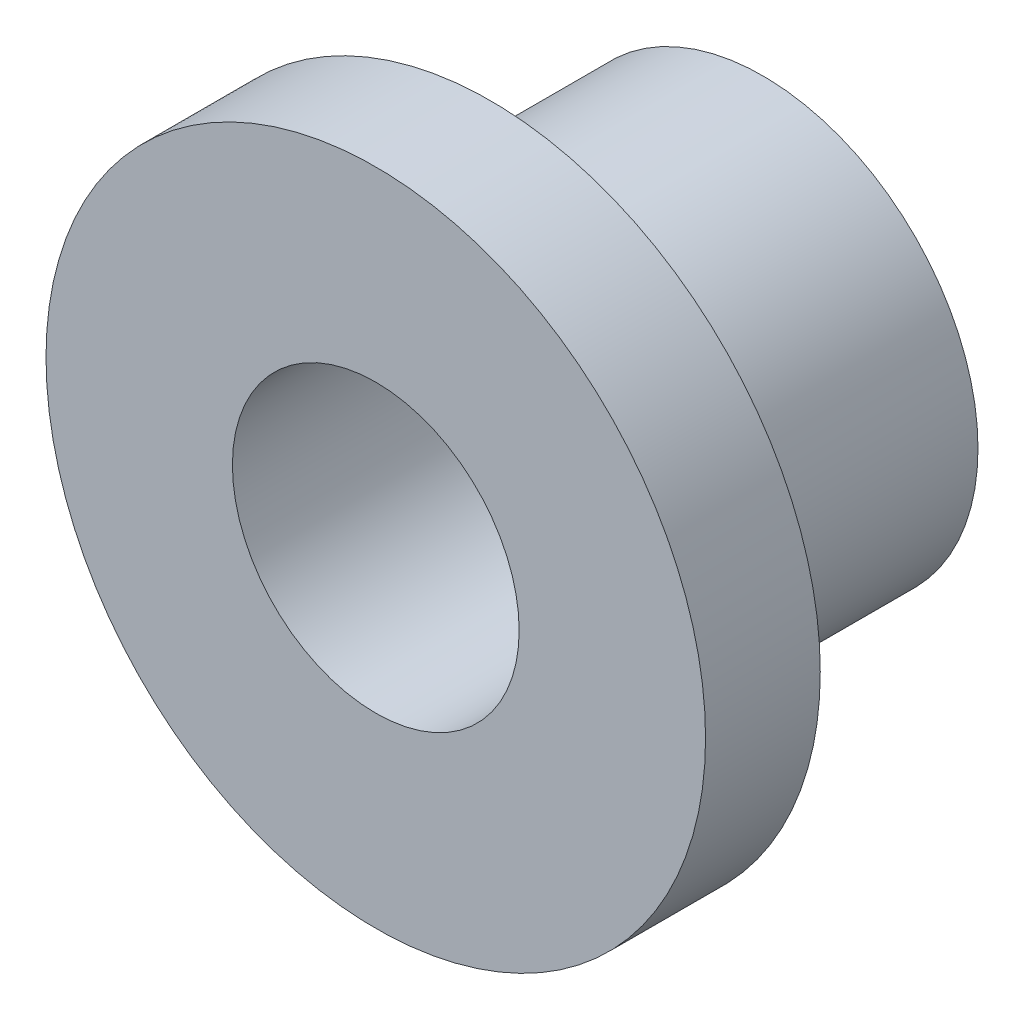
ISO-10303-21;
HEADER;
FILE_DESCRIPTION(('STEP AP214'),'2;1');
FILE_NAME('part.step','',(''),(''),'','','');
FILE_SCHEMA(('AUTOMOTIVE_DESIGN { 1 0 10303 214 1 1 1 1 }'));
ENDSEC;
DATA;
#1=APPLICATION_CONTEXT('core data for automotive mechanical design processes');
#2=APPLICATION_PROTOCOL_DEFINITION('international standard','automotive_design',2000,#1);
#3=PRODUCT_CONTEXT('',#1,'mechanical');
#4=PRODUCT('Part','Part','',(#3));
#5=PRODUCT_RELATED_PRODUCT_CATEGORY('part','',(#4));
#6=PRODUCT_DEFINITION_FORMATION('','',#4);
#7=PRODUCT_DEFINITION_CONTEXT('part definition',#1,'design');
#8=PRODUCT_DEFINITION('design','',#6,#7);
#9=PRODUCT_DEFINITION_SHAPE('','',#8);
#10=(LENGTH_UNIT() NAMED_UNIT(*) SI_UNIT(.MILLI.,.METRE.));
#11=(NAMED_UNIT(*) PLANE_ANGLE_UNIT() SI_UNIT($,.RADIAN.));
#12=(NAMED_UNIT(*) SI_UNIT($,.STERADIAN.) SOLID_ANGLE_UNIT());
#13=UNCERTAINTY_MEASURE_WITH_UNIT(LENGTH_MEASURE(1.E-05),#10,'distance_accuracy_value','');
#14=(GEOMETRIC_REPRESENTATION_CONTEXT(3) GLOBAL_UNCERTAINTY_ASSIGNED_CONTEXT((#13)) GLOBAL_UNIT_ASSIGNED_CONTEXT((#10,
#11,#12)) REPRESENTATION_CONTEXT('',''));
#15=CARTESIAN_POINT('',(0.,0.,0.));
#16=DIRECTION('',(0.,0.,1.));
#17=DIRECTION('',(1.,0.,0.));
#18=AXIS2_PLACEMENT_3D('',#15,#16,#17);
#19=CARTESIAN_POINT('',(0.,0.,27.));
#20=DIRECTION('',(0.,0.,-1.));
#21=DIRECTION('',(-1.,0.,0.));
#22=AXIS2_PLACEMENT_3D('',#19,#20,#21);
#23=CYLINDRICAL_SURFACE('',#22,15.);
#24=CARTESIAN_POINT('',(0.,0.,0.));
#25=DIRECTION('',(0.,0.,1.));
#26=DIRECTION('',(1.,0.,0.));
#27=AXIS2_PLACEMENT_3D('',#24,#25,#26);
#28=CIRCLE('',#27,15.);
#29=CARTESIAN_POINT('',(15.,0.,0.));
#30=VERTEX_POINT('',#29);
#31=EDGE_CURVE('E17',#30,#30,#28,.T.);
#32=ORIENTED_EDGE('',*,*,#31,.T.);
#33=EDGE_LOOP('',(#32));
#34=FACE_BOUND('',#33,.T.);
#35=CARTESIAN_POINT('',(0.,0.,19.));
#36=DIRECTION('',(0.,0.,1.));
#37=DIRECTION('',(1.,0.,0.));
#38=AXIS2_PLACEMENT_3D('',#35,#36,#37);
#39=CIRCLE('',#38,15.);
#40=CARTESIAN_POINT('',(15.,0.,19.));
#41=VERTEX_POINT('',#40);
#42=EDGE_CURVE('E10',#41,#41,#39,.T.);
#43=ORIENTED_EDGE('',*,*,#42,.F.);
#44=EDGE_LOOP('',(#43));
#45=FACE_BOUND('',#44,.T.);
#46=ADVANCED_FACE('F14',(#34,#45),#23,.T.);
#47=CARTESIAN_POINT('',(0.,0.,27.));
#48=DIRECTION('',(0.,0.,1.));
#49=DIRECTION('',(1.,0.,0.));
#50=AXIS2_PLACEMENT_3D('',#47,#48,#49);
#51=PLANE('',#50);
#52=CARTESIAN_POINT('',(0.,0.,27.));
#53=DIRECTION('',(0.,0.,1.));
#54=DIRECTION('',(1.,0.,0.));
#55=AXIS2_PLACEMENT_3D('',#52,#53,#54);
#56=CIRCLE('',#55,10.);
#57=CARTESIAN_POINT('',(10.,0.,27.));
#58=VERTEX_POINT('',#57);
#59=EDGE_CURVE('E25',#58,#58,#56,.T.);
#60=ORIENTED_EDGE('',*,*,#59,.F.);
#61=EDGE_LOOP('',(#60));
#62=FACE_BOUND('',#61,.T.);
#63=CARTESIAN_POINT('',(0.,0.,27.));
#64=DIRECTION('',(0.,0.,1.));
#65=DIRECTION('',(1.,0.,0.));
#66=AXIS2_PLACEMENT_3D('',#63,#64,#65);
#67=CIRCLE('',#66,23.);
#68=CARTESIAN_POINT('',(23.,0.,27.));
#69=VERTEX_POINT('',#68);
#70=EDGE_CURVE('E28',#69,#69,#67,.T.);
#71=ORIENTED_EDGE('',*,*,#70,.T.);
#72=EDGE_LOOP('',(#71));
#73=FACE_BOUND('',#72,.T.);
#74=ADVANCED_FACE('F42',(#62,#73),#51,.T.);
#75=CARTESIAN_POINT('',(0.,0.,0.));
#76=DIRECTION('',(0.,0.,1.));
#77=DIRECTION('',(1.,0.,0.));
#78=AXIS2_PLACEMENT_3D('',#75,#76,#77);
#79=PLANE('',#78);
#80=ORIENTED_EDGE('',*,*,#31,.F.);
#81=EDGE_LOOP('',(#80));
#82=FACE_BOUND('',#81,.T.);
#83=CARTESIAN_POINT('',(0.,0.,0.));
#84=DIRECTION('',(0.,0.,1.));
#85=DIRECTION('',(1.,0.,0.));
#86=AXIS2_PLACEMENT_3D('',#83,#84,#85);
#87=CIRCLE('',#86,10.);
#88=CARTESIAN_POINT('',(10.,0.,0.));
#89=VERTEX_POINT('',#88);
#90=EDGE_CURVE('E31',#89,#89,#87,.T.);
#91=ORIENTED_EDGE('',*,*,#90,.T.);
#92=EDGE_LOOP('',(#91));
#93=FACE_BOUND('',#92,.T.);
#94=ADVANCED_FACE('F63',(#82,#93),#79,.F.);
#95=CARTESIAN_POINT('',(0.,0.,27.));
#96=DIRECTION('',(0.,0.,-1.));
#97=DIRECTION('',(-1.,0.,0.));
#98=AXIS2_PLACEMENT_3D('',#95,#96,#97);
#99=CYLINDRICAL_SURFACE('',#98,10.);
#100=ORIENTED_EDGE('',*,*,#59,.T.);
#101=EDGE_LOOP('',(#100));
#102=FACE_BOUND('',#101,.T.);
#103=ORIENTED_EDGE('',*,*,#90,.F.);
#104=EDGE_LOOP('',(#103));
#105=FACE_BOUND('',#104,.T.);
#106=ADVANCED_FACE('F53',(#102,#105),#99,.F.);
#107=CARTESIAN_POINT('',(0.,0.,19.));
#108=DIRECTION('',(0.,0.,1.));
#109=DIRECTION('',(1.,0.,0.));
#110=AXIS2_PLACEMENT_3D('',#107,#108,#109);
#111=PLANE('',#110);
#112=CARTESIAN_POINT('',(0.,0.,19.));
#113=DIRECTION('',(0.,0.,1.));
#114=DIRECTION('',(1.,0.,0.));
#115=AXIS2_PLACEMENT_3D('',#112,#113,#114);
#116=CIRCLE('',#115,23.);
#117=CARTESIAN_POINT('',(23.,0.,19.));
#118=VERTEX_POINT('',#117);
#119=EDGE_CURVE('E33',#118,#118,#116,.T.);
#120=ORIENTED_EDGE('',*,*,#119,.F.);
#121=EDGE_LOOP('',(#120));
#122=FACE_BOUND('',#121,.T.);
#123=ORIENTED_EDGE('',*,*,#42,.T.);
#124=EDGE_LOOP('',(#123));
#125=FACE_BOUND('',#124,.T.);
#126=ADVANCED_FACE('F46',(#122,#125),#111,.F.);
#127=CARTESIAN_POINT('',(0.,0.,19.));
#128=DIRECTION('',(0.,0.,1.));
#129=DIRECTION('',(1.,0.,0.));
#130=AXIS2_PLACEMENT_3D('',#127,#128,#129);
#131=CYLINDRICAL_SURFACE('',#130,23.);
#132=ORIENTED_EDGE('',*,*,#119,.T.);
#133=EDGE_LOOP('',(#132));
#134=FACE_BOUND('',#133,.T.);
#135=ORIENTED_EDGE('',*,*,#70,.F.);
#136=EDGE_LOOP('',(#135));
#137=FACE_BOUND('',#136,.T.);
#138=ADVANCED_FACE('F44',(#134,#137),#131,.T.);
#139=CLOSED_SHELL('',(#46,#74,#94,#106,#126,#138));
#140=MANIFOLD_SOLID_BREP('B1',#139);
#141=ADVANCED_BREP_SHAPE_REPRESENTATION('',(#18,#140),#14);
#142=SHAPE_DEFINITION_REPRESENTATION(#9,#141);
ENDSEC;
END-ISO-10303-21;
